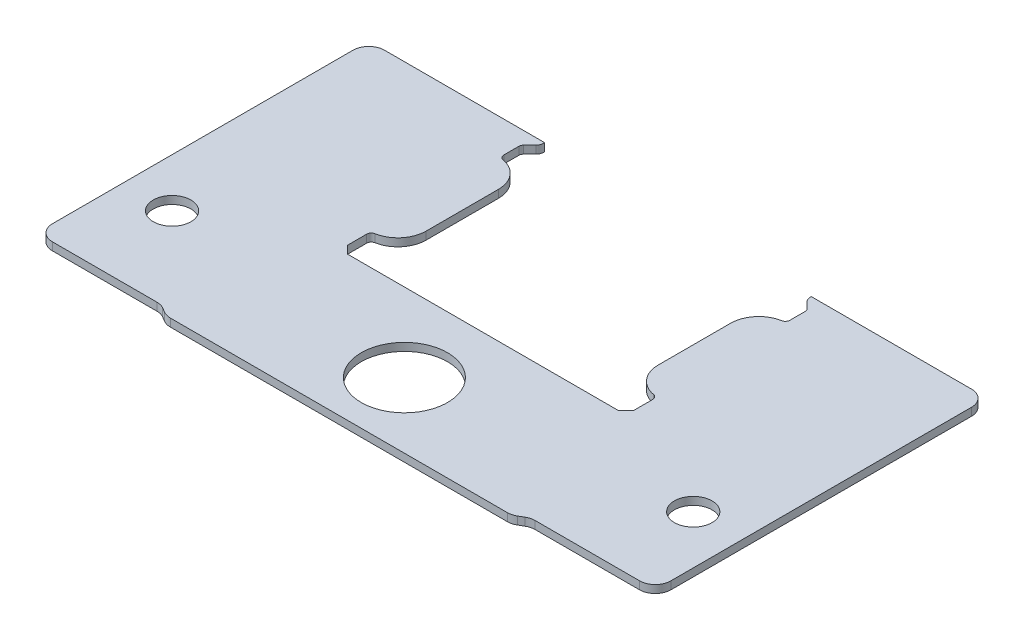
ISO-10303-21;
HEADER;
FILE_DESCRIPTION(('STEP AP214'),'2;1');
FILE_NAME('part.step','',(''),(''),'','','');
FILE_SCHEMA(('AUTOMOTIVE_DESIGN { 1 0 10303 214 1 1 1 1 }'));
ENDSEC;
DATA;
#1=APPLICATION_CONTEXT('core data for automotive mechanical design processes');
#2=APPLICATION_PROTOCOL_DEFINITION('international standard','automotive_design',2000,#1);
#3=PRODUCT_CONTEXT('',#1,'mechanical');
#4=PRODUCT('Part','Part','',(#3));
#5=PRODUCT_RELATED_PRODUCT_CATEGORY('part','',(#4));
#6=PRODUCT_DEFINITION_FORMATION('','',#4);
#7=PRODUCT_DEFINITION_CONTEXT('part definition',#1,'design');
#8=PRODUCT_DEFINITION('design','',#6,#7);
#9=PRODUCT_DEFINITION_SHAPE('','',#8);
#10=(LENGTH_UNIT() NAMED_UNIT(*) SI_UNIT(.MILLI.,.METRE.));
#11=(NAMED_UNIT(*) PLANE_ANGLE_UNIT() SI_UNIT($,.RADIAN.));
#12=(NAMED_UNIT(*) SI_UNIT($,.STERADIAN.) SOLID_ANGLE_UNIT());
#13=UNCERTAINTY_MEASURE_WITH_UNIT(LENGTH_MEASURE(1.E-05),#10,'distance_accuracy_value','');
#14=(GEOMETRIC_REPRESENTATION_CONTEXT(3) GLOBAL_UNCERTAINTY_ASSIGNED_CONTEXT((#13)) GLOBAL_UNIT_ASSIGNED_CONTEXT((#10,
#11,#12)) REPRESENTATION_CONTEXT('',''));
#15=CARTESIAN_POINT('',(0.,0.,0.));
#16=DIRECTION('',(0.,0.,1.));
#17=DIRECTION('',(1.,0.,0.));
#18=AXIS2_PLACEMENT_3D('',#15,#16,#17);
#19=CARTESIAN_POINT('',(-8.991250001,85.3,4.634879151));
#20=DIRECTION('',(0.,1.,0.));
#21=DIRECTION('',(-1.,0.,0.));
#22=AXIS2_PLACEMENT_3D('',#19,#20,#21);
#23=CYLINDRICAL_SURFACE('',#22,0.499999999);
#24=CARTESIAN_POINT('',(-8.99125000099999,85.8,4.634879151));
#25=DIRECTION('',(0.,1.,0.));
#26=DIRECTION('',(-1.,0.,0.));
#27=AXIS2_PLACEMENT_3D('',#24,#25,#26);
#28=CIRCLE('',#27,0.499999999);
#29=CARTESIAN_POINT('',(-8.49547717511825,85.8,4.57));
#30=VERTEX_POINT('',#29);
#31=CARTESIAN_POINT('',(-8.63769660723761,85.8,4.98843253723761));
#32=VERTEX_POINT('',#31);
#33=EDGE_CURVE('E521',#30,#32,#28,.F.);
#34=ORIENTED_EDGE('',*,*,#33,.T.);
#35=DIRECTION('',(0.,-1.,0.));
#36=VECTOR('',#35,1.);
#37=CARTESIAN_POINT('',(-8.637696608,85.55,4.988432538));
#38=LINE('',#37,#36);
#39=CARTESIAN_POINT('',(-8.63769660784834,85.3,4.98843254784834));
#40=VERTEX_POINT('',#39);
#41=EDGE_CURVE('E454',#32,#40,#38,.T.);
#42=ORIENTED_EDGE('',*,*,#41,.T.);
#43=CARTESIAN_POINT('',(-8.991250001,85.3,4.634879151));
#44=DIRECTION('',(0.,1.,0.));
#45=DIRECTION('',(-1.,0.,0.));
#46=AXIS2_PLACEMENT_3D('',#43,#44,#45);
#47=CIRCLE('',#46,0.499999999);
#48=CARTESIAN_POINT('',(-8.49547717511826,85.3,4.57));
#49=VERTEX_POINT('',#48);
#50=EDGE_CURVE('E292',#49,#40,#47,.F.);
#51=ORIENTED_EDGE('',*,*,#50,.F.);
#52=DIRECTION('',(0.,-1.,0.));
#53=VECTOR('',#52,1.);
#54=CARTESIAN_POINT('',(-8.495477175,85.55,4.57));
#55=LINE('',#54,#53);
#56=EDGE_CURVE('E284',#30,#49,#55,.T.);
#57=ORIENTED_EDGE('',*,*,#56,.F.);
#58=EDGE_LOOP('',(#34,#42,#51,#57));
#59=FACE_BOUND('',#58,.T.);
#60=ADVANCED_FACE('F17',(#59),#23,.T.);
#61=CARTESIAN_POINT('',(-8.637696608,85.3,4.988432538));
#62=DIRECTION('',(-0.707106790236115,0.,-0.70710677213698));
#63=DIRECTION('',(-0.70710677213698,0.,0.707106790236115));
#64=AXIS2_PLACEMENT_3D('',#61,#62,#63);
#65=PLANE('',#64);
#66=DIRECTION('',(-0.70710677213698,0.,0.707106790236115));
#67=VECTOR('',#66,1.);
#68=CARTESIAN_POINT('',(-8.637696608,85.8,4.988432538));
#69=LINE('',#68,#67);
#70=CARTESIAN_POINT('',(-9.02838202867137,85.8,5.37911796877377));
#71=VERTEX_POINT('',#70);
#72=EDGE_CURVE('E518',#32,#71,#69,.T.);
#73=ORIENTED_EDGE('',*,*,#72,.T.);
#74=DIRECTION('',(0.,-1.,0.));
#75=VECTOR('',#74,1.);
#76=CARTESIAN_POINT('',(-9.02838203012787,85.55,5.37911797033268));
#77=LINE('',#76,#75);
#78=CARTESIAN_POINT('',(-9.02838202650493,85.3,5.37911796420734));
#79=VERTEX_POINT('',#78);
#80=EDGE_CURVE('E452',#79,#71,#77,.F.);
#81=ORIENTED_EDGE('',*,*,#80,.F.);
#82=DIRECTION('',(-0.707106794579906,0.,0.707106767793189));
#83=VECTOR('',#82,1.);
#84=CARTESIAN_POINT('',(-8.6376965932,85.3,4.9884325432));
#85=LINE('',#84,#83);
#86=EDGE_CURVE('E294',#40,#79,#85,.T.);
#87=ORIENTED_EDGE('',*,*,#86,.F.);
#88=ORIENTED_EDGE('',*,*,#41,.F.);
#89=EDGE_LOOP('',(#73,#81,#87,#88));
#90=FACE_BOUND('',#89,.T.);
#91=ADVANCED_FACE('F588',(#90),#65,.F.);
#92=CARTESIAN_POINT('',(-8.816249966,85.3,5.591250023));
#93=DIRECTION('',(0.,1.,0.));
#94=DIRECTION('',(-1.,0.,0.));
#95=AXIS2_PLACEMENT_3D('',#92,#93,#94);
#96=CYLINDRICAL_SURFACE('',#95,0.300000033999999);
#97=DIRECTION('',(0.,-1.,0.));
#98=VECTOR('',#97,1.);
#99=CARTESIAN_POINT('',(-9.11625,85.55,5.591250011));
#100=LINE('',#99,#98);
#101=CARTESIAN_POINT('',(-9.1162500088,85.8,5.591250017));
#102=VERTEX_POINT('',#101);
#103=CARTESIAN_POINT('',(-9.1162500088,85.3,5.591250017));
#104=VERTEX_POINT('',#103);
#105=EDGE_CURVE('E449',#102,#104,#100,.T.);
#106=ORIENTED_EDGE('',*,*,#105,.T.);
#107=CARTESIAN_POINT('',(-8.816249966,85.3,5.591250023));
#108=DIRECTION('',(0.,1.,0.));
#109=DIRECTION('',(-1.,0.,0.));
#110=AXIS2_PLACEMENT_3D('',#107,#108,#109);
#111=CIRCLE('',#110,0.300000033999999);
#112=EDGE_CURVE('E582',#79,#104,#111,.T.);
#113=ORIENTED_EDGE('',*,*,#112,.F.);
#114=ORIENTED_EDGE('',*,*,#80,.T.);
#115=CARTESIAN_POINT('',(-8.81624996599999,85.8,5.591250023));
#116=DIRECTION('',(0.,1.,0.));
#117=DIRECTION('',(-1.,0.,0.));
#118=AXIS2_PLACEMENT_3D('',#115,#116,#117);
#119=CIRCLE('',#118,0.300000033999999);
#120=EDGE_CURVE('E355',#71,#102,#119,.T.);
#121=ORIENTED_EDGE('',*,*,#120,.T.);
#122=EDGE_LOOP('',(#106,#113,#114,#121));
#123=FACE_BOUND('',#122,.T.);
#124=ADVANCED_FACE('F592',(#123),#96,.F.);
#125=CARTESIAN_POINT('',(-9.11625,85.3,5.591250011));
#126=DIRECTION('',(-1.,0.,0.));
#127=DIRECTION('',(0.,0.,1.));
#128=AXIS2_PLACEMENT_3D('',#125,#126,#127);
#129=PLANE('',#128);
#130=DIRECTION('',(0.,0.,1.));
#131=VECTOR('',#130,1.);
#132=CARTESIAN_POINT('',(-9.1162500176,85.8,15.37));
#133=LINE('',#132,#131);
#134=CARTESIAN_POINT('',(-9.1162500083,85.8,6.5485079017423));
#135=VERTEX_POINT('',#134);
#136=EDGE_CURVE('E352',#102,#135,#133,.T.);
#137=ORIENTED_EDGE('',*,*,#136,.T.);
#138=DIRECTION('',(0.,-1.,0.));
#139=VECTOR('',#138,1.);
#140=CARTESIAN_POINT('',(-9.116249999,85.55,6.54850790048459));
#141=LINE('',#140,#139);
#142=CARTESIAN_POINT('',(-9.1162500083,85.3,6.5485079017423));
#143=VERTEX_POINT('',#142);
#144=EDGE_CURVE('E447',#143,#135,#141,.F.);
#145=ORIENTED_EDGE('',*,*,#144,.F.);
#146=DIRECTION('',(0.,0.,1.));
#147=VECTOR('',#146,1.);
#148=CARTESIAN_POINT('',(-9.1162500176,85.3,15.37));
#149=LINE('',#148,#147);
#150=EDGE_CURVE('E297',#104,#143,#149,.T.);
#151=ORIENTED_EDGE('',*,*,#150,.F.);
#152=ORIENTED_EDGE('',*,*,#105,.F.);
#153=EDGE_LOOP('',(#137,#145,#151,#152));
#154=FACE_BOUND('',#153,.T.);
#155=ADVANCED_FACE('F597',(#154),#129,.F.);
#156=CARTESIAN_POINT('',(-8.816250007,85.3,6.548507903));
#157=DIRECTION('',(0.,1.,0.));
#158=DIRECTION('',(-1.,0.,0.));
#159=AXIS2_PLACEMENT_3D('',#156,#157,#158);
#160=CYLINDRICAL_SURFACE('',#159,0.299999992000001);
#161=DIRECTION('',(0.,1.,0.));
#162=VECTOR('',#161,1.);
#163=CARTESIAN_POINT('',(-8.87013637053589,85.55,6.84362864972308));
#164=LINE('',#163,#162);
#165=CARTESIAN_POINT('',(-8.87013637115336,85.8,6.84362864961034));
#166=VERTEX_POINT('',#165);
#167=CARTESIAN_POINT('',(-8.87013637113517,85.3,6.84362864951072));
#168=VERTEX_POINT('',#167);
#169=EDGE_CURVE('E444',#166,#168,#164,.F.);
#170=ORIENTED_EDGE('',*,*,#169,.T.);
#171=CARTESIAN_POINT('',(-8.816250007,85.3,6.548507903));
#172=DIRECTION('',(0.,1.,0.));
#173=DIRECTION('',(-1.,0.,0.));
#174=AXIS2_PLACEMENT_3D('',#171,#172,#173);
#175=CIRCLE('',#174,0.299999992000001);
#176=EDGE_CURVE('E580',#143,#168,#175,.T.);
#177=ORIENTED_EDGE('',*,*,#176,.F.);
#178=ORIENTED_EDGE('',*,*,#144,.T.);
#179=CARTESIAN_POINT('',(-8.81625000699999,85.8,6.548507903));
#180=DIRECTION('',(0.,1.,0.));
#181=DIRECTION('',(-1.,0.,0.));
#182=AXIS2_PLACEMENT_3D('',#179,#180,#181);
#183=CIRCLE('',#182,0.299999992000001);
#184=EDGE_CURVE('E354',#135,#166,#183,.T.);
#185=ORIENTED_EDGE('',*,*,#184,.T.);
#186=EDGE_LOOP('',(#170,#177,#178,#185));
#187=FACE_BOUND('',#186,.T.);
#188=ADVANCED_FACE('F601',(#187),#160,.F.);
#189=CARTESIAN_POINT('',(-9.193993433,85.3,8.617304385));
#190=DIRECTION('',(0.,1.,0.));
#191=DIRECTION('',(-1.,0.,0.));
#192=AXIS2_PLACEMENT_3D('',#189,#190,#191);
#193=CYLINDRICAL_SURFACE('',#192,1.803000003);
#194=CARTESIAN_POINT('',(-9.193993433,85.8,8.617304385));
#195=DIRECTION('',(0.,1.,0.));
#196=DIRECTION('',(-1.,0.,0.));
#197=AXIS2_PLACEMENT_3D('',#194,#195,#196);
#198=CIRCLE('',#197,1.803000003);
#199=CARTESIAN_POINT('',(-7.3909934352,85.8,8.617304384));
#200=VERTEX_POINT('',#199);
#201=EDGE_CURVE('E351',#166,#200,#198,.F.);
#202=ORIENTED_EDGE('',*,*,#201,.T.);
#203=DIRECTION('',(0.,-1.,0.));
#204=VECTOR('',#203,1.);
#205=CARTESIAN_POINT('',(-7.39099343,85.55,8.617304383));
#206=LINE('',#205,#204);
#207=CARTESIAN_POINT('',(-7.3909934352,85.3,8.617304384));
#208=VERTEX_POINT('',#207);
#209=EDGE_CURVE('E441',#200,#208,#206,.T.);
#210=ORIENTED_EDGE('',*,*,#209,.T.);
#211=CARTESIAN_POINT('',(-9.193993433,85.3,8.617304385));
#212=DIRECTION('',(0.,1.,0.));
#213=DIRECTION('',(-1.,0.,0.));
#214=AXIS2_PLACEMENT_3D('',#211,#212,#213);
#215=CIRCLE('',#214,1.803000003);
#216=EDGE_CURVE('E578',#168,#208,#215,.F.);
#217=ORIENTED_EDGE('',*,*,#216,.F.);
#218=ORIENTED_EDGE('',*,*,#169,.F.);
#219=EDGE_LOOP('',(#202,#210,#217,#218));
#220=FACE_BOUND('',#219,.T.);
#221=ADVANCED_FACE('F605',(#220),#193,.T.);
#222=CARTESIAN_POINT('',(-7.39099343,85.3,8.617304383));
#223=DIRECTION('',(-1.,0.,0.));
#224=DIRECTION('',(0.,0.,1.));
#225=AXIS2_PLACEMENT_3D('',#222,#223,#224);
#226=PLANE('',#225);
#227=DIRECTION('',(0.,0.,1.));
#228=VECTOR('',#227,1.);
#229=CARTESIAN_POINT('',(-7.3909934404,85.8,15.37));
#230=LINE('',#229,#228);
#231=CARTESIAN_POINT('',(-7.3909934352,85.8,13.2226956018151));
#232=VERTEX_POINT('',#231);
#233=EDGE_CURVE('E347',#200,#232,#230,.T.);
#234=ORIENTED_EDGE('',*,*,#233,.T.);
#235=DIRECTION('',(0.,1.,0.));
#236=VECTOR('',#235,1.);
#237=CARTESIAN_POINT('',(-7.39099343,85.55,13.2226956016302));
#238=LINE('',#237,#236);
#239=CARTESIAN_POINT('',(-7.3909934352,85.3,13.2226956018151));
#240=VERTEX_POINT('',#239);
#241=EDGE_CURVE('E438',#232,#240,#238,.F.);
#242=ORIENTED_EDGE('',*,*,#241,.T.);
#243=DIRECTION('',(0.,0.,1.));
#244=VECTOR('',#243,1.);
#245=CARTESIAN_POINT('',(-7.3909934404,85.3,15.37));
#246=LINE('',#245,#244);
#247=EDGE_CURVE('E577',#208,#240,#246,.T.);
#248=ORIENTED_EDGE('',*,*,#247,.F.);
#249=ORIENTED_EDGE('',*,*,#209,.F.);
#250=EDGE_LOOP('',(#234,#242,#248,#249));
#251=FACE_BOUND('',#250,.T.);
#252=ADVANCED_FACE('F609',(#251),#226,.F.);
#253=CARTESIAN_POINT('',(-9.193993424,85.3,13.222695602));
#254=DIRECTION('',(0.,1.,0.));
#255=DIRECTION('',(-1.,0.,0.));
#256=AXIS2_PLACEMENT_3D('',#253,#254,#255);
#257=CYLINDRICAL_SURFACE('',#256,1.802999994);
#258=CARTESIAN_POINT('',(-9.193993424,85.8,13.222695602));
#259=DIRECTION('',(0.,1.,0.));
#260=DIRECTION('',(-1.,0.,0.));
#261=AXIS2_PLACEMENT_3D('',#258,#259,#260);
#262=CIRCLE('',#261,1.802999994);
#263=CARTESIAN_POINT('',(-8.87013636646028,85.8,14.9963713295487));
#264=VERTEX_POINT('',#263);
#265=EDGE_CURVE('E350',#232,#264,#262,.F.);
#266=ORIENTED_EDGE('',*,*,#265,.T.);
#267=DIRECTION('',(0.,-1.,0.));
#268=VECTOR('',#267,1.);
#269=CARTESIAN_POINT('',(-8.87013636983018,85.55,14.996371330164));
#270=LINE('',#269,#268);
#271=CARTESIAN_POINT('',(-8.87013636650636,85.3,14.9963713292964));
#272=VERTEX_POINT('',#271);
#273=EDGE_CURVE('E436',#272,#264,#270,.F.);
#274=ORIENTED_EDGE('',*,*,#273,.F.);
#275=CARTESIAN_POINT('',(-9.193993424,85.3,13.222695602));
#276=DIRECTION('',(0.,1.,0.));
#277=DIRECTION('',(-1.,0.,0.));
#278=AXIS2_PLACEMENT_3D('',#275,#276,#277);
#279=CIRCLE('',#278,1.802999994);
#280=EDGE_CURVE('E575',#240,#272,#279,.F.);
#281=ORIENTED_EDGE('',*,*,#280,.F.);
#282=ORIENTED_EDGE('',*,*,#241,.F.);
#283=EDGE_LOOP('',(#266,#274,#281,#282));
#284=FACE_BOUND('',#283,.T.);
#285=ADVANCED_FACE('F666',(#284),#257,.T.);
#286=CARTESIAN_POINT('',(-8.816249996,85.3,15.291492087));
#287=DIRECTION('',(0.,1.,0.));
#288=DIRECTION('',(-1.,0.,0.));
#289=AXIS2_PLACEMENT_3D('',#286,#287,#288);
#290=CYLINDRICAL_SURFACE('',#289,0.300000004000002);
#291=DIRECTION('',(0.,-1.,0.));
#292=VECTOR('',#291,1.);
#293=CARTESIAN_POINT('',(-9.11625,85.55,15.291492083));
#294=LINE('',#293,#292);
#295=CARTESIAN_POINT('',(-9.1162500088,85.8,15.291492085));
#296=VERTEX_POINT('',#295);
#297=CARTESIAN_POINT('',(-9.1162500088,85.3,15.291492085));
#298=VERTEX_POINT('',#297);
#299=EDGE_CURVE('E433',#296,#298,#294,.T.);
#300=ORIENTED_EDGE('',*,*,#299,.T.);
#301=CARTESIAN_POINT('',(-8.816249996,85.3,15.291492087));
#302=DIRECTION('',(0.,1.,0.));
#303=DIRECTION('',(-1.,0.,0.));
#304=AXIS2_PLACEMENT_3D('',#301,#302,#303);
#305=CIRCLE('',#304,0.300000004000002);
#306=EDGE_CURVE('E573',#272,#298,#305,.T.);
#307=ORIENTED_EDGE('',*,*,#306,.F.);
#308=ORIENTED_EDGE('',*,*,#273,.T.);
#309=CARTESIAN_POINT('',(-8.81624999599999,85.8,15.291492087));
#310=DIRECTION('',(0.,1.,0.));
#311=DIRECTION('',(-1.,0.,0.));
#312=AXIS2_PLACEMENT_3D('',#309,#310,#311);
#313=CIRCLE('',#312,0.300000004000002);
#314=EDGE_CURVE('E346',#264,#296,#313,.T.);
#315=ORIENTED_EDGE('',*,*,#314,.T.);
#316=EDGE_LOOP('',(#300,#307,#308,#315));
#317=FACE_BOUND('',#316,.T.);
#318=ADVANCED_FACE('F671',(#317),#290,.F.);
#319=CARTESIAN_POINT('',(-9.11625,85.3,15.291492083));
#320=DIRECTION('',(-1.,0.,0.));
#321=DIRECTION('',(0.,0.,1.));
#322=AXIS2_PLACEMENT_3D('',#319,#320,#321);
#323=PLANE('',#322);
#324=DIRECTION('',(0.,0.,1.));
#325=VECTOR('',#324,1.);
#326=CARTESIAN_POINT('',(-9.1162500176,85.8,15.37));
#327=LINE('',#326,#325);
#328=CARTESIAN_POINT('',(-9.1162500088,85.8,16.5087499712));
#329=VERTEX_POINT('',#328);
#330=EDGE_CURVE('E342',#296,#329,#327,.T.);
#331=ORIENTED_EDGE('',*,*,#330,.T.);
#332=DIRECTION('',(0.,-1.,0.));
#333=VECTOR('',#332,1.);
#334=CARTESIAN_POINT('',(-9.11625,85.55,16.50874998));
#335=LINE('',#334,#333);
#336=CARTESIAN_POINT('',(-9.1162500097,85.3,16.5087499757));
#337=VERTEX_POINT('',#336);
#338=EDGE_CURVE('E430',#329,#337,#335,.T.);
#339=ORIENTED_EDGE('',*,*,#338,.T.);
#340=DIRECTION('',(0.,0.,1.));
#341=VECTOR('',#340,1.);
#342=CARTESIAN_POINT('',(-9.1162500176,85.3,15.37));
#343=LINE('',#342,#341);
#344=EDGE_CURVE('E572',#298,#337,#343,.T.);
#345=ORIENTED_EDGE('',*,*,#344,.F.);
#346=ORIENTED_EDGE('',*,*,#299,.F.);
#347=EDGE_LOOP('',(#331,#339,#345,#346));
#348=FACE_BOUND('',#347,.T.);
#349=ADVANCED_FACE('F667',(#348),#323,.F.);
#350=CARTESIAN_POINT('',(-9.11625,85.3,16.50874998));
#351=DIRECTION('',(-0.707106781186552,0.,0.707106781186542));
#352=DIRECTION('',(0.707106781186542,0.,0.707106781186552));
#353=AXIS2_PLACEMENT_3D('',#350,#351,#352);
#354=PLANE('',#353);
#355=DIRECTION('',(0.707106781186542,0.,0.707106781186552));
#356=VECTOR('',#355,1.);
#357=CARTESIAN_POINT('',(-9.11625,85.8,16.50874998));
#358=LINE('',#357,#356);
#359=CARTESIAN_POINT('',(-8.6250000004,85.8,16.9999999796));
#360=VERTEX_POINT('',#359);
#361=EDGE_CURVE('E345',#329,#360,#358,.T.);
#362=ORIENTED_EDGE('',*,*,#361,.T.);
#363=DIRECTION('',(0.,-1.,0.));
#364=VECTOR('',#363,1.);
#365=CARTESIAN_POINT('',(-8.625,85.55,16.99999998));
#366=LINE('',#365,#364);
#367=CARTESIAN_POINT('',(-8.6249999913,85.3,16.9999999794));
#368=VERTEX_POINT('',#367);
#369=EDGE_CURVE('E424',#360,#368,#366,.T.);
#370=ORIENTED_EDGE('',*,*,#369,.T.);
#371=DIRECTION('',(0.707106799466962,0.,0.707106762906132));
#372=VECTOR('',#371,1.);
#373=CARTESIAN_POINT('',(-9.1162500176,85.3,16.5087499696));
#374=LINE('',#373,#372);
#375=EDGE_CURVE('E459',#337,#368,#374,.T.);
#376=ORIENTED_EDGE('',*,*,#375,.F.);
#377=ORIENTED_EDGE('',*,*,#338,.F.);
#378=EDGE_LOOP('',(#362,#370,#376,#377));
#379=FACE_BOUND('',#378,.T.);
#380=ADVANCED_FACE('F670',(#379),#354,.F.);
#381=CARTESIAN_POINT('',(-8.625,85.8,16.99999998));
#382=DIRECTION('',(0.,0.,1.));
#383=DIRECTION('',(0.,-1.,0.));
#384=AXIS2_PLACEMENT_3D('',#381,#382,#383);
#385=PLANE('',#384);
#386=DIRECTION('',(1.,0.,0.));
#387=VECTOR('',#386,1.);
#388=CARTESIAN_POINT('',(0.,85.8,16.9999999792));
#389=LINE('',#388,#387);
#390=CARTESIAN_POINT('',(8.6250000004,85.8,16.9999999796));
#391=VERTEX_POINT('',#390);
#392=EDGE_CURVE('E425',#360,#391,#389,.T.);
#393=ORIENTED_EDGE('',*,*,#392,.T.);
#394=DIRECTION('',(0.,-1.,0.));
#395=VECTOR('',#394,1.);
#396=CARTESIAN_POINT('',(8.625,85.55,16.99999998));
#397=LINE('',#396,#395);
#398=CARTESIAN_POINT('',(8.6249999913,85.3,16.9999999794));
#399=VERTEX_POINT('',#398);
#400=EDGE_CURVE('E421',#391,#399,#397,.T.);
#401=ORIENTED_EDGE('',*,*,#400,.T.);
#402=DIRECTION('',(1.,0.,0.));
#403=VECTOR('',#402,1.);
#404=CARTESIAN_POINT('',(0.,85.3,16.9999999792));
#405=LINE('',#404,#403);
#406=EDGE_CURVE('E457',#368,#399,#405,.T.);
#407=ORIENTED_EDGE('',*,*,#406,.F.);
#408=ORIENTED_EDGE('',*,*,#369,.F.);
#409=EDGE_LOOP('',(#393,#401,#407,#408));
#410=FACE_BOUND('',#409,.T.);
#411=ADVANCED_FACE('F675',(#410),#385,.F.);
#412=CARTESIAN_POINT('',(8.625,85.3,16.99999998));
#413=DIRECTION('',(0.707106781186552,0.,0.707106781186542));
#414=DIRECTION('',(0.707106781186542,0.,-0.707106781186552));
#415=AXIS2_PLACEMENT_3D('',#412,#413,#414);
#416=PLANE('',#415);
#417=DIRECTION('',(0.707106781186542,0.,-0.707106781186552));
#418=VECTOR('',#417,1.);
#419=CARTESIAN_POINT('',(8.625,85.8,16.99999998));
#420=LINE('',#419,#418);
#421=CARTESIAN_POINT('',(9.1162500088,85.8,16.5087499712));
#422=VERTEX_POINT('',#421);
#423=EDGE_CURVE('E341',#391,#422,#420,.T.);
#424=ORIENTED_EDGE('',*,*,#423,.T.);
#425=DIRECTION('',(0.,-1.,0.));
#426=VECTOR('',#425,1.);
#427=CARTESIAN_POINT('',(9.11625,85.55,16.50874998));
#428=LINE('',#427,#426);
#429=CARTESIAN_POINT('',(9.1162500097,85.3,16.5087499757));
#430=VERTEX_POINT('',#429);
#431=EDGE_CURVE('E418',#422,#430,#428,.T.);
#432=ORIENTED_EDGE('',*,*,#431,.T.);
#433=DIRECTION('',(0.70710679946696,0.,-0.707106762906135));
#434=VECTOR('',#433,1.);
#435=CARTESIAN_POINT('',(8.6249999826,85.3,16.9999999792));
#436=LINE('',#435,#434);
#437=EDGE_CURVE('E458',#399,#430,#436,.T.);
#438=ORIENTED_EDGE('',*,*,#437,.F.);
#439=ORIENTED_EDGE('',*,*,#400,.F.);
#440=EDGE_LOOP('',(#424,#432,#438,#439));
#441=FACE_BOUND('',#440,.T.);
#442=ADVANCED_FACE('F679',(#441),#416,.F.);
#443=CARTESIAN_POINT('',(9.11625,85.3,16.50874998));
#444=DIRECTION('',(1.,0.,0.));
#445=DIRECTION('',(0.,0.,-1.));
#446=AXIS2_PLACEMENT_3D('',#443,#444,#445);
#447=PLANE('',#446);
#448=DIRECTION('',(0.,0.,-1.));
#449=VECTOR('',#448,1.);
#450=CARTESIAN_POINT('',(9.1162500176,85.8,15.37));
#451=LINE('',#450,#449);
#452=CARTESIAN_POINT('',(9.1162500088,85.8,15.2914920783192));
#453=VERTEX_POINT('',#452);
#454=EDGE_CURVE('E337',#422,#453,#451,.T.);
#455=ORIENTED_EDGE('',*,*,#454,.T.);
#456=DIRECTION('',(0.,-1.,0.));
#457=VECTOR('',#456,1.);
#458=CARTESIAN_POINT('',(9.11625,85.55,15.2914920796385));
#459=LINE('',#458,#457);
#460=CARTESIAN_POINT('',(9.1162500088,85.3,15.2914920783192));
#461=VERTEX_POINT('',#460);
#462=EDGE_CURVE('E416',#461,#453,#459,.F.);
#463=ORIENTED_EDGE('',*,*,#462,.F.);
#464=DIRECTION('',(0.,0.,-1.));
#465=VECTOR('',#464,1.);
#466=CARTESIAN_POINT('',(9.1162500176,85.3,15.37));
#467=LINE('',#466,#465);
#468=EDGE_CURVE('E569',#430,#461,#467,.T.);
#469=ORIENTED_EDGE('',*,*,#468,.F.);
#470=ORIENTED_EDGE('',*,*,#431,.F.);
#471=EDGE_LOOP('',(#455,#463,#469,#470));
#472=FACE_BOUND('',#471,.T.);
#473=ADVANCED_FACE('F683',(#472),#447,.F.);
#474=CARTESIAN_POINT('',(8.816250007,85.3,15.291492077));
#475=DIRECTION('',(0.,1.,0.));
#476=DIRECTION('',(-1.,0.,0.));
#477=AXIS2_PLACEMENT_3D('',#474,#475,#476);
#478=CYLINDRICAL_SURFACE('',#477,0.299999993);
#479=DIRECTION('',(0.,1.,0.));
#480=VECTOR('',#479,1.);
#481=CARTESIAN_POINT('',(8.87013636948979,85.55,14.9963713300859));
#482=LINE('',#481,#480);
#483=CARTESIAN_POINT('',(8.87013637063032,85.8,14.9963713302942));
#484=VERTEX_POINT('',#483);
#485=CARTESIAN_POINT('',(8.87013637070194,85.3,14.9963713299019));
#486=VERTEX_POINT('',#485);
#487=EDGE_CURVE('E413',#484,#486,#482,.F.);
#488=ORIENTED_EDGE('',*,*,#487,.T.);
#489=CARTESIAN_POINT('',(8.816250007,85.3,15.291492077));
#490=DIRECTION('',(0.,1.,0.));
#491=DIRECTION('',(-1.,0.,0.));
#492=AXIS2_PLACEMENT_3D('',#489,#490,#491);
#493=CIRCLE('',#492,0.299999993);
#494=EDGE_CURVE('E567',#461,#486,#493,.T.);
#495=ORIENTED_EDGE('',*,*,#494,.F.);
#496=ORIENTED_EDGE('',*,*,#462,.T.);
#497=CARTESIAN_POINT('',(8.81625000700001,85.8,15.291492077));
#498=DIRECTION('',(0.,1.,0.));
#499=DIRECTION('',(-1.,0.,0.));
#500=AXIS2_PLACEMENT_3D('',#497,#498,#499);
#501=CIRCLE('',#500,0.299999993);
#502=EDGE_CURVE('E340',#453,#484,#501,.T.);
#503=ORIENTED_EDGE('',*,*,#502,.T.);
#504=EDGE_LOOP('',(#488,#495,#496,#503));
#505=FACE_BOUND('',#504,.T.);
#506=ADVANCED_FACE('F687',(#505),#478,.F.);
#507=CARTESIAN_POINT('',(9.193993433,85.3,13.222695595));
#508=DIRECTION('',(0.,1.,0.));
#509=DIRECTION('',(-1.,0.,0.));
#510=AXIS2_PLACEMENT_3D('',#507,#508,#509);
#511=CYLINDRICAL_SURFACE('',#510,1.803000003);
#512=CARTESIAN_POINT('',(9.193993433,85.8,13.222695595));
#513=DIRECTION('',(0.,1.,0.));
#514=DIRECTION('',(-1.,0.,0.));
#515=AXIS2_PLACEMENT_3D('',#512,#513,#514);
#516=CIRCLE('',#515,1.803000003);
#517=CARTESIAN_POINT('',(7.3909934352,85.8,13.222695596));
#518=VERTEX_POINT('',#517);
#519=EDGE_CURVE('E336',#484,#518,#516,.F.);
#520=ORIENTED_EDGE('',*,*,#519,.T.);
#521=DIRECTION('',(0.,-1.,0.));
#522=VECTOR('',#521,1.);
#523=CARTESIAN_POINT('',(7.39099343,85.55,13.222695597));
#524=LINE('',#523,#522);
#525=CARTESIAN_POINT('',(7.3909934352,85.3,13.222695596));
#526=VERTEX_POINT('',#525);
#527=EDGE_CURVE('E410',#518,#526,#524,.T.);
#528=ORIENTED_EDGE('',*,*,#527,.T.);
#529=CARTESIAN_POINT('',(9.193993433,85.3,13.222695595));
#530=DIRECTION('',(0.,1.,0.));
#531=DIRECTION('',(-1.,0.,0.));
#532=AXIS2_PLACEMENT_3D('',#529,#530,#531);
#533=CIRCLE('',#532,1.803000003);
#534=EDGE_CURVE('E565',#486,#526,#533,.F.);
#535=ORIENTED_EDGE('',*,*,#534,.F.);
#536=ORIENTED_EDGE('',*,*,#487,.F.);
#537=EDGE_LOOP('',(#520,#528,#535,#536));
#538=FACE_BOUND('',#537,.T.);
#539=ADVANCED_FACE('F693',(#538),#511,.T.);
#540=CARTESIAN_POINT('',(7.39099343,85.3,13.222695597));
#541=DIRECTION('',(1.,0.,0.));
#542=DIRECTION('',(0.,0.,-1.));
#543=AXIS2_PLACEMENT_3D('',#540,#541,#542);
#544=PLANE('',#543);
#545=DIRECTION('',(0.,0.,-1.));
#546=VECTOR('',#545,1.);
#547=CARTESIAN_POINT('',(7.3909934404,85.8,15.37));
#548=LINE('',#547,#546);
#549=CARTESIAN_POINT('',(7.3909934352,85.8,8.6173043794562));
#550=VERTEX_POINT('',#549);
#551=EDGE_CURVE('E332',#518,#550,#548,.T.);
#552=ORIENTED_EDGE('',*,*,#551,.T.);
#553=DIRECTION('',(0.,1.,0.));
#554=VECTOR('',#553,1.);
#555=CARTESIAN_POINT('',(7.39099343,85.55,8.6173043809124));
#556=LINE('',#555,#554);
#557=CARTESIAN_POINT('',(7.3909934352,85.3,8.6173043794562));
#558=VERTEX_POINT('',#557);
#559=EDGE_CURVE('E407',#550,#558,#556,.F.);
#560=ORIENTED_EDGE('',*,*,#559,.T.);
#561=DIRECTION('',(0.,0.,-1.));
#562=VECTOR('',#561,1.);
#563=CARTESIAN_POINT('',(7.3909934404,85.3,15.37));
#564=LINE('',#563,#562);
#565=EDGE_CURVE('E564',#526,#558,#564,.T.);
#566=ORIENTED_EDGE('',*,*,#565,.F.);
#567=ORIENTED_EDGE('',*,*,#527,.F.);
#568=EDGE_LOOP('',(#552,#560,#566,#567));
#569=FACE_BOUND('',#568,.T.);
#570=ADVANCED_FACE('F689',(#569),#544,.F.);
#571=CARTESIAN_POINT('',(9.193993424,85.3,8.617304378));
#572=DIRECTION('',(0.,1.,0.));
#573=DIRECTION('',(-1.,0.,0.));
#574=AXIS2_PLACEMENT_3D('',#571,#572,#573);
#575=CYLINDRICAL_SURFACE('',#574,1.802999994);
#576=CARTESIAN_POINT('',(9.193993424,85.8,8.617304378));
#577=DIRECTION('',(0.,1.,0.));
#578=DIRECTION('',(-1.,0.,0.));
#579=AXIS2_PLACEMENT_3D('',#576,#577,#578);
#580=CIRCLE('',#579,1.802999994);
#581=CARTESIAN_POINT('',(8.87013636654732,85.8,6.84362865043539));
#582=VERTEX_POINT('',#581);
#583=EDGE_CURVE('E335',#550,#582,#580,.F.);
#584=ORIENTED_EDGE('',*,*,#583,.T.);
#585=DIRECTION('',(0.,-1.,0.));
#586=VECTOR('',#585,1.);
#587=CARTESIAN_POINT('',(8.87013637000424,85.55,6.84362864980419));
#588=LINE('',#587,#586);
#589=CARTESIAN_POINT('',(8.87013636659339,85.3,6.8436286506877));
#590=VERTEX_POINT('',#589);
#591=EDGE_CURVE('E405',#590,#582,#588,.F.);
#592=ORIENTED_EDGE('',*,*,#591,.F.);
#593=CARTESIAN_POINT('',(9.193993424,85.3,8.617304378));
#594=DIRECTION('',(0.,1.,0.));
#595=DIRECTION('',(-1.,0.,0.));
#596=AXIS2_PLACEMENT_3D('',#593,#594,#595);
#597=CIRCLE('',#596,1.802999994);
#598=EDGE_CURVE('E562',#558,#590,#597,.F.);
#599=ORIENTED_EDGE('',*,*,#598,.F.);
#600=ORIENTED_EDGE('',*,*,#559,.F.);
#601=EDGE_LOOP('',(#584,#592,#599,#600));
#602=FACE_BOUND('',#601,.T.);
#603=ADVANCED_FACE('F692',(#602),#575,.T.);
#604=CARTESIAN_POINT('',(8.816249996,85.3,6.548507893));
#605=DIRECTION('',(0.,1.,0.));
#606=DIRECTION('',(-1.,0.,0.));
#607=AXIS2_PLACEMENT_3D('',#604,#605,#606);
#608=CYLINDRICAL_SURFACE('',#607,0.300000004);
#609=DIRECTION('',(0.,-1.,0.));
#610=VECTOR('',#609,1.);
#611=CARTESIAN_POINT('',(9.11625,85.55,6.548507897));
#612=LINE('',#611,#610);
#613=CARTESIAN_POINT('',(9.1162500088,85.8,6.548507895));
#614=VERTEX_POINT('',#613);
#615=CARTESIAN_POINT('',(9.1162500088,85.3,6.548507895));
#616=VERTEX_POINT('',#615);
#617=EDGE_CURVE('E402',#614,#616,#612,.T.);
#618=ORIENTED_EDGE('',*,*,#617,.T.);
#619=CARTESIAN_POINT('',(8.816249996,85.3,6.548507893));
#620=DIRECTION('',(0.,1.,0.));
#621=DIRECTION('',(-1.,0.,0.));
#622=AXIS2_PLACEMENT_3D('',#619,#620,#621);
#623=CIRCLE('',#622,0.300000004);
#624=EDGE_CURVE('E560',#590,#616,#623,.T.);
#625=ORIENTED_EDGE('',*,*,#624,.F.);
#626=ORIENTED_EDGE('',*,*,#591,.T.);
#627=CARTESIAN_POINT('',(8.81624999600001,85.8,6.548507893));
#628=DIRECTION('',(0.,1.,0.));
#629=DIRECTION('',(-1.,0.,0.));
#630=AXIS2_PLACEMENT_3D('',#627,#628,#629);
#631=CIRCLE('',#630,0.300000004);
#632=EDGE_CURVE('E331',#582,#614,#631,.T.);
#633=ORIENTED_EDGE('',*,*,#632,.T.);
#634=EDGE_LOOP('',(#618,#625,#626,#633));
#635=FACE_BOUND('',#634,.T.);
#636=ADVANCED_FACE('F699',(#635),#608,.F.);
#637=CARTESIAN_POINT('',(9.11625,85.3,6.548507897));
#638=DIRECTION('',(1.,0.,0.));
#639=DIRECTION('',(0.,0.,-1.));
#640=AXIS2_PLACEMENT_3D('',#637,#638,#639);
#641=PLANE('',#640);
#642=DIRECTION('',(0.,0.,-1.));
#643=VECTOR('',#642,1.);
#644=CARTESIAN_POINT('',(9.1162500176,85.8,15.37));
#645=LINE('',#644,#643);
#646=CARTESIAN_POINT('',(9.1162500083,85.8,5.59124999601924));
#647=VERTEX_POINT('',#646);
#648=EDGE_CURVE('E327',#614,#647,#645,.T.);
#649=ORIENTED_EDGE('',*,*,#648,.T.);
#650=DIRECTION('',(0.,-1.,0.));
#651=VECTOR('',#650,1.);
#652=CARTESIAN_POINT('',(9.116249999,85.55,5.59125000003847));
#653=LINE('',#652,#651);
#654=CARTESIAN_POINT('',(9.1162500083,85.3,5.59124999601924));
#655=VERTEX_POINT('',#654);
#656=EDGE_CURVE('E400',#655,#647,#653,.F.);
#657=ORIENTED_EDGE('',*,*,#656,.F.);
#658=DIRECTION('',(0.,0.,-1.));
#659=VECTOR('',#658,1.);
#660=CARTESIAN_POINT('',(9.1162500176,85.3,15.37));
#661=LINE('',#660,#659);
#662=EDGE_CURVE('E559',#616,#655,#661,.T.);
#663=ORIENTED_EDGE('',*,*,#662,.F.);
#664=ORIENTED_EDGE('',*,*,#617,.F.);
#665=EDGE_LOOP('',(#649,#657,#663,#664));
#666=FACE_BOUND('',#665,.T.);
#667=ADVANCED_FACE('F695',(#666),#641,.F.);
#668=CARTESIAN_POINT('',(8.81625004,85.3,5.591249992));
#669=DIRECTION('',(0.,1.,0.));
#670=DIRECTION('',(-1.,0.,0.));
#671=AXIS2_PLACEMENT_3D('',#668,#669,#670);
#672=CYLINDRICAL_SURFACE('',#671,0.299999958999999);
#673=DIRECTION('',(0.,-1.,0.));
#674=VECTOR('',#673,1.);
#675=CARTESIAN_POINT('',(9.028382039,85.55,5.379117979));
#676=LINE('',#675,#674);
#677=CARTESIAN_POINT('',(9.02838204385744,85.8,5.37911798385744));
#678=VERTEX_POINT('',#677);
#679=CARTESIAN_POINT('',(9.02838203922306,85.3,5.37911798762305));
#680=VERTEX_POINT('',#679);
#681=EDGE_CURVE('E397',#678,#680,#676,.T.);
#682=ORIENTED_EDGE('',*,*,#681,.T.);
#683=CARTESIAN_POINT('',(8.81625004,85.3,5.591249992));
#684=DIRECTION('',(0.,1.,0.));
#685=DIRECTION('',(-1.,0.,0.));
#686=AXIS2_PLACEMENT_3D('',#683,#684,#685);
#687=CIRCLE('',#686,0.299999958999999);
#688=EDGE_CURVE('E557',#655,#680,#687,.T.);
#689=ORIENTED_EDGE('',*,*,#688,.F.);
#690=ORIENTED_EDGE('',*,*,#656,.T.);
#691=CARTESIAN_POINT('',(8.81625004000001,85.8,5.591249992));
#692=DIRECTION('',(0.,1.,0.));
#693=DIRECTION('',(-1.,0.,0.));
#694=AXIS2_PLACEMENT_3D('',#691,#692,#693);
#695=CIRCLE('',#694,0.299999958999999);
#696=EDGE_CURVE('E330',#647,#678,#695,.T.);
#697=ORIENTED_EDGE('',*,*,#696,.T.);
#698=EDGE_LOOP('',(#682,#689,#690,#697));
#699=FACE_BOUND('',#698,.T.);
#700=ADVANCED_FACE('F698',(#699),#672,.F.);
#701=CARTESIAN_POINT('',(9.028382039,85.3,5.379117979));
#702=DIRECTION('',(0.707106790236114,0.,-0.707106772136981));
#703=DIRECTION('',(-0.707106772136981,0.,-0.707106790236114));
#704=AXIS2_PLACEMENT_3D('',#701,#702,#703);
#705=PLANE('',#704);
#706=DIRECTION('',(-0.707106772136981,0.,-0.707106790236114));
#707=VECTOR('',#706,1.);
#708=CARTESIAN_POINT('',(9.028382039,85.8,5.379117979));
#709=LINE('',#708,#707);
#710=CARTESIAN_POINT('',(8.63769660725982,85.8,4.98843253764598));
#711=VERTEX_POINT('',#710);
#712=EDGE_CURVE('E491',#678,#711,#709,.T.);
#713=ORIENTED_EDGE('',*,*,#712,.T.);
#714=DIRECTION('',(0.,1.,0.));
#715=VECTOR('',#714,1.);
#716=CARTESIAN_POINT('',(8.63769660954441,85.55,4.98843254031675));
#717=LINE('',#716,#715);
#718=CARTESIAN_POINT('',(8.63769660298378,85.3,4.98843254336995));
#719=VERTEX_POINT('',#718);
#720=EDGE_CURVE('E394',#711,#719,#717,.F.);
#721=ORIENTED_EDGE('',*,*,#720,.T.);
#722=DIRECTION('',(-0.707106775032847,0.,-0.707106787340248));
#723=VECTOR('',#722,1.);
#724=CARTESIAN_POINT('',(9.0283820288,85.3,5.3791179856));
#725=LINE('',#724,#723);
#726=EDGE_CURVE('E555',#680,#719,#725,.T.);
#727=ORIENTED_EDGE('',*,*,#726,.F.);
#728=ORIENTED_EDGE('',*,*,#681,.F.);
#729=EDGE_LOOP('',(#713,#721,#727,#728));
#730=FACE_BOUND('',#729,.T.);
#731=ADVANCED_FACE('F701',(#730),#705,.F.);
#732=CARTESIAN_POINT('',(8.991249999,85.3,4.63487915));
#733=DIRECTION('',(0.,1.,0.));
#734=DIRECTION('',(-1.,0.,0.));
#735=AXIS2_PLACEMENT_3D('',#732,#733,#734);
#736=CYLINDRICAL_SURFACE('',#735,0.499999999);
#737=CARTESIAN_POINT('',(8.99124999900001,85.8,4.63487915));
#738=DIRECTION('',(0.,1.,0.));
#739=DIRECTION('',(-1.,0.,0.));
#740=AXIS2_PLACEMENT_3D('',#737,#738,#739);
#741=CIRCLE('',#740,0.499999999);
#742=CARTESIAN_POINT('',(8.49547717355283,85.8,4.57));
#743=VERTEX_POINT('',#742);
#744=EDGE_CURVE('E326',#711,#743,#741,.F.);
#745=ORIENTED_EDGE('',*,*,#744,.T.);
#746=DIRECTION('',(0.,1.,0.));
#747=VECTOR('',#746,1.);
#748=CARTESIAN_POINT('',(8.495477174,85.55,4.57));
#749=LINE('',#748,#747);
#750=CARTESIAN_POINT('',(8.49547717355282,85.3,4.57));
#751=VERTEX_POINT('',#750);
#752=EDGE_CURVE('E392',#751,#743,#749,.T.);
#753=ORIENTED_EDGE('',*,*,#752,.F.);
#754=CARTESIAN_POINT('',(8.991249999,85.3,4.63487915));
#755=DIRECTION('',(0.,1.,0.));
#756=DIRECTION('',(-1.,0.,0.));
#757=AXIS2_PLACEMENT_3D('',#754,#755,#756);
#758=CIRCLE('',#757,0.499999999);
#759=EDGE_CURVE('E553',#719,#751,#758,.F.);
#760=ORIENTED_EDGE('',*,*,#759,.F.);
#761=ORIENTED_EDGE('',*,*,#720,.F.);
#762=EDGE_LOOP('',(#745,#753,#760,#761));
#763=FACE_BOUND('',#762,.T.);
#764=ADVANCED_FACE('F704',(#763),#736,.T.);
#765=CARTESIAN_POINT('',(8.495477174,85.3,4.57));
#766=DIRECTION('',(0.,0.,-1.));
#767=DIRECTION('',(0.,1.,0.));
#768=AXIS2_PLACEMENT_3D('',#765,#766,#767);
#769=PLANE('',#768);
#770=ORIENTED_EDGE('',*,*,#752,.T.);
#771=DIRECTION('',(1.,0.,0.));
#772=VECTOR('',#771,1.);
#773=CARTESIAN_POINT('',(0.,85.8,4.57));
#774=LINE('',#773,#772);
#775=CARTESIAN_POINT('',(18.7,85.8,4.57));
#776=VERTEX_POINT('',#775);
#777=EDGE_CURVE('E323',#743,#776,#774,.T.);
#778=ORIENTED_EDGE('',*,*,#777,.T.);
#779=DIRECTION('',(0.,1.,0.));
#780=VECTOR('',#779,1.);
#781=CARTESIAN_POINT('',(18.7,85.55,4.57));
#782=LINE('',#781,#780);
#783=CARTESIAN_POINT('',(18.7,85.3,4.57));
#784=VERTEX_POINT('',#783);
#785=EDGE_CURVE('E389',#776,#784,#782,.F.);
#786=ORIENTED_EDGE('',*,*,#785,.T.);
#787=DIRECTION('',(1.,0.,0.));
#788=VECTOR('',#787,1.);
#789=CARTESIAN_POINT('',(0.,85.3,4.57));
#790=LINE('',#789,#788);
#791=EDGE_CURVE('E552',#751,#784,#790,.T.);
#792=ORIENTED_EDGE('',*,*,#791,.F.);
#793=EDGE_LOOP('',(#770,#778,#786,#792));
#794=FACE_BOUND('',#793,.T.);
#795=ADVANCED_FACE('F706',(#794),#769,.T.);
#796=CARTESIAN_POINT('',(18.7,85.8,5.57));
#797=DIRECTION('',(0.,-1.,0.));
#798=DIRECTION('',(0.,0.,-1.));
#799=AXIS2_PLACEMENT_3D('',#796,#797,#798);
#800=CYLINDRICAL_SURFACE('',#799,1.);
#801=DIRECTION('',(0.,1.,0.));
#802=VECTOR('',#801,1.);
#803=CARTESIAN_POINT('',(19.7,85.55,5.57));
#804=LINE('',#803,#802);
#805=CARTESIAN_POINT('',(19.7,85.3,5.57));
#806=VERTEX_POINT('',#805);
#807=CARTESIAN_POINT('',(19.7,85.8,5.57));
#808=VERTEX_POINT('',#807);
#809=EDGE_CURVE('E387',#806,#808,#804,.T.);
#810=ORIENTED_EDGE('',*,*,#809,.F.);
#811=CARTESIAN_POINT('',(18.7,85.3,5.57));
#812=DIRECTION('',(0.,-1.,0.));
#813=DIRECTION('',(0.,0.,-1.));
#814=AXIS2_PLACEMENT_3D('',#811,#812,#813);
#815=CIRCLE('',#814,1.);
#816=EDGE_CURVE('E550',#784,#806,#815,.T.);
#817=ORIENTED_EDGE('',*,*,#816,.F.);
#818=ORIENTED_EDGE('',*,*,#785,.F.);
#819=CARTESIAN_POINT('',(18.7,85.8,5.57));
#820=DIRECTION('',(0.,-1.,0.));
#821=DIRECTION('',(0.,0.,-1.));
#822=AXIS2_PLACEMENT_3D('',#819,#820,#821);
#823=CIRCLE('',#822,1.);
#824=EDGE_CURVE('E322',#776,#808,#823,.T.);
#825=ORIENTED_EDGE('',*,*,#824,.T.);
#826=EDGE_LOOP('',(#810,#817,#818,#825));
#827=FACE_BOUND('',#826,.T.);
#828=ADVANCED_FACE('F709',(#827),#800,.T.);
#829=CARTESIAN_POINT('',(19.7,85.3,24.72));
#830=DIRECTION('',(1.,0.,0.));
#831=DIRECTION('',(0.,0.,-1.));
#832=AXIS2_PLACEMENT_3D('',#829,#830,#831);
#833=PLANE('',#832);
#834=DIRECTION('',(0.,0.,1.));
#835=VECTOR('',#834,1.);
#836=CARTESIAN_POINT('',(19.7,85.3,15.37));
#837=LINE('',#836,#835);
#838=CARTESIAN_POINT('',(19.7,85.3,24.7200000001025));
#839=VERTEX_POINT('',#838);
#840=EDGE_CURVE('E549',#806,#839,#837,.T.);
#841=ORIENTED_EDGE('',*,*,#840,.F.);
#842=ORIENTED_EDGE('',*,*,#809,.T.);
#843=DIRECTION('',(0.,0.,1.));
#844=VECTOR('',#843,1.);
#845=CARTESIAN_POINT('',(19.7,85.8,15.37));
#846=LINE('',#845,#844);
#847=CARTESIAN_POINT('',(19.7,85.8,24.7200000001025));
#848=VERTEX_POINT('',#847);
#849=EDGE_CURVE('E319',#808,#848,#846,.T.);
#850=ORIENTED_EDGE('',*,*,#849,.T.);
#851=DIRECTION('',(0.,1.,0.));
#852=VECTOR('',#851,1.);
#853=CARTESIAN_POINT('',(19.7,85.55,24.7200000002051));
#854=LINE('',#853,#852);
#855=EDGE_CURVE('E384',#848,#839,#854,.F.);
#856=ORIENTED_EDGE('',*,*,#855,.T.);
#857=EDGE_LOOP('',(#841,#842,#850,#856));
#858=FACE_BOUND('',#857,.T.);
#859=ADVANCED_FACE('F711',(#858),#833,.T.);
#860=CARTESIAN_POINT('',(18.7,85.8,24.72));
#861=DIRECTION('',(0.,-1.,0.));
#862=DIRECTION('',(0.,0.,-1.));
#863=AXIS2_PLACEMENT_3D('',#860,#861,#862);
#864=CYLINDRICAL_SURFACE('',#863,1.);
#865=DIRECTION('',(0.,1.,0.));
#866=VECTOR('',#865,1.);
#867=CARTESIAN_POINT('',(18.7,85.55,25.72));
#868=LINE('',#867,#866);
#869=CARTESIAN_POINT('',(18.7,85.3,25.7200000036));
#870=VERTEX_POINT('',#869);
#871=CARTESIAN_POINT('',(18.7,85.8,25.7200000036));
#872=VERTEX_POINT('',#871);
#873=EDGE_CURVE('E382',#870,#872,#868,.T.);
#874=ORIENTED_EDGE('',*,*,#873,.F.);
#875=CARTESIAN_POINT('',(18.7,85.3,24.72));
#876=DIRECTION('',(0.,-1.,0.));
#877=DIRECTION('',(0.,0.,-1.));
#878=AXIS2_PLACEMENT_3D('',#875,#876,#877);
#879=CIRCLE('',#878,1.);
#880=EDGE_CURVE('E547',#839,#870,#879,.T.);
#881=ORIENTED_EDGE('',*,*,#880,.F.);
#882=ORIENTED_EDGE('',*,*,#855,.F.);
#883=CARTESIAN_POINT('',(18.7,85.8,24.72));
#884=DIRECTION('',(0.,-1.,0.));
#885=DIRECTION('',(0.,0.,-1.));
#886=AXIS2_PLACEMENT_3D('',#883,#884,#885);
#887=CIRCLE('',#886,1.);
#888=EDGE_CURVE('E318',#848,#872,#887,.T.);
#889=ORIENTED_EDGE('',*,*,#888,.T.);
#890=EDGE_LOOP('',(#874,#881,#882,#889));
#891=FACE_BOUND('',#890,.T.);
#892=ADVANCED_FACE('F714',(#891),#864,.T.);
#893=CARTESIAN_POINT('',(12.047372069,85.8,25.72));
#894=DIRECTION('',(0.,0.,1.));
#895=DIRECTION('',(0.,-1.,0.));
#896=AXIS2_PLACEMENT_3D('',#893,#894,#895);
#897=PLANE('',#896);
#898=DIRECTION('',(0.,-1.,0.));
#899=VECTOR('',#898,1.);
#900=CARTESIAN_POINT('',(12.0473720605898,85.55,25.71999999));
#901=LINE('',#900,#899);
#902=CARTESIAN_POINT('',(12.0473720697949,85.3,25.7199999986));
#903=VERTEX_POINT('',#902);
#904=CARTESIAN_POINT('',(12.0473720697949,85.8,25.7199999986));
#905=VERTEX_POINT('',#904);
#906=EDGE_CURVE('E380',#903,#905,#901,.F.);
#907=ORIENTED_EDGE('',*,*,#906,.F.);
#908=DIRECTION('',(-1.,0.,0.));
#909=VECTOR('',#908,1.);
#910=CARTESIAN_POINT('',(0.,85.3,25.7200000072));
#911=LINE('',#910,#909);
#912=EDGE_CURVE('E546',#870,#903,#911,.T.);
#913=ORIENTED_EDGE('',*,*,#912,.F.);
#914=ORIENTED_EDGE('',*,*,#873,.T.);
#915=DIRECTION('',(-1.,0.,0.));
#916=VECTOR('',#915,1.);
#917=CARTESIAN_POINT('',(0.,85.8,25.7200000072));
#918=LINE('',#917,#916);
#919=EDGE_CURVE('E314',#872,#905,#918,.T.);
#920=ORIENTED_EDGE('',*,*,#919,.T.);
#921=EDGE_LOOP('',(#907,#913,#914,#920));
#922=FACE_BOUND('',#921,.T.);
#923=ADVANCED_FACE('F716',(#922),#897,.T.);
#924=CARTESIAN_POINT('',(12.047372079,85.3,26.720000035));
#925=DIRECTION('',(0.,1.,0.));
#926=DIRECTION('',(-1.,0.,0.));
#927=AXIS2_PLACEMENT_3D('',#924,#925,#926);
#928=CYLINDRICAL_SURFACE('',#927,1.000000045);
#929=CARTESIAN_POINT('',(12.047372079,85.8,26.720000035));
#930=DIRECTION('',(0.,1.,0.));
#931=DIRECTION('',(-1.,0.,0.));
#932=AXIS2_PLACEMENT_3D('',#929,#930,#931);
#933=CIRCLE('',#932,1.000000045);
#934=CARTESIAN_POINT('',(11.5473720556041,85.8,25.8539745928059));
#935=VERTEX_POINT('',#934);
#936=EDGE_CURVE('E317',#905,#935,#933,.T.);
#937=ORIENTED_EDGE('',*,*,#936,.T.);
#938=DIRECTION('',(0.,1.,0.));
#939=VECTOR('',#938,1.);
#940=CARTESIAN_POINT('',(11.547372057,85.55,25.853974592));
#941=LINE('',#940,#939);
#942=CARTESIAN_POINT('',(11.5473720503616,85.3,25.8539745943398));
#943=VERTEX_POINT('',#942);
#944=EDGE_CURVE('E378',#943,#935,#941,.T.);
#945=ORIENTED_EDGE('',*,*,#944,.F.);
#946=CARTESIAN_POINT('',(12.047372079,85.3,26.720000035));
#947=DIRECTION('',(0.,1.,0.));
#948=DIRECTION('',(-1.,0.,0.));
#949=AXIS2_PLACEMENT_3D('',#946,#947,#948);
#950=CIRCLE('',#949,1.000000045);
#951=EDGE_CURVE('E544',#903,#943,#950,.T.);
#952=ORIENTED_EDGE('',*,*,#951,.F.);
#953=ORIENTED_EDGE('',*,*,#906,.T.);
#954=EDGE_LOOP('',(#937,#945,#952,#953));
#955=FACE_BOUND('',#954,.T.);
#956=ADVANCED_FACE('F719',(#955),#928,.F.);
#957=CARTESIAN_POINT('',(11.232050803,85.3,26.036025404));
#958=DIRECTION('',(0.500000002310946,0.,0.866025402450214));
#959=DIRECTION('',(0.866025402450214,0.,-0.500000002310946));
#960=AXIS2_PLACEMENT_3D('',#957,#958,#959);
#961=PLANE('',#960);
#962=DIRECTION('',(0.866025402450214,0.,-0.500000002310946));
#963=VECTOR('',#962,1.);
#964=CARTESIAN_POINT('',(11.232050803,85.8,26.036025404));
#965=LINE('',#964,#963);
#966=CARTESIAN_POINT('',(11.232050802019,85.8,26.0360254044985));
#967=VERTEX_POINT('',#966);
#968=EDGE_CURVE('E480',#935,#967,#965,.F.);
#969=ORIENTED_EDGE('',*,*,#968,.T.);
#970=DIRECTION('',(0.,1.,0.));
#971=VECTOR('',#970,1.);
#972=CARTESIAN_POINT('',(11.2320508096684,85.55,26.0360254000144));
#973=LINE('',#972,#971);
#974=CARTESIAN_POINT('',(11.2320508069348,85.3,26.0360254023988));
#975=VERTEX_POINT('',#974);
#976=EDGE_CURVE('E375',#967,#975,#973,.F.);
#977=ORIENTED_EDGE('',*,*,#976,.T.);
#978=DIRECTION('',(-0.866025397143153,0.,0.500000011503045));
#979=VECTOR('',#978,1.);
#980=CARTESIAN_POINT('',(11.5473720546,85.3,25.8539745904));
#981=LINE('',#980,#979);
#982=EDGE_CURVE('E542',#943,#975,#981,.T.);
#983=ORIENTED_EDGE('',*,*,#982,.F.);
#984=ORIENTED_EDGE('',*,*,#944,.T.);
#985=EDGE_LOOP('',(#969,#977,#983,#984));
#986=FACE_BOUND('',#985,.T.);
#987=ADVANCED_FACE('F721',(#986),#961,.T.);
#988=CARTESIAN_POINT('',(10.732050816,85.3,25.170000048));
#989=DIRECTION('',(0.,1.,0.));
#990=DIRECTION('',(-1.,0.,0.));
#991=AXIS2_PLACEMENT_3D('',#988,#989,#990);
#992=CYLINDRICAL_SURFACE('',#991,0.999999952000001);
#993=ORIENTED_EDGE('',*,*,#976,.F.);
#994=CARTESIAN_POINT('',(10.732050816,85.8,25.170000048));
#995=DIRECTION('',(0.,1.,0.));
#996=DIRECTION('',(-1.,0.,0.));
#997=AXIS2_PLACEMENT_3D('',#994,#995,#996);
#998=CIRCLE('',#997,0.999999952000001);
#999=CARTESIAN_POINT('',(10.7320508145,85.8,26.17));
#1000=VERTEX_POINT('',#999);
#1001=EDGE_CURVE('E313',#967,#1000,#998,.F.);
#1002=ORIENTED_EDGE('',*,*,#1001,.T.);
#1003=DIRECTION('',(0.,1.,0.));
#1004=VECTOR('',#1003,1.);
#1005=CARTESIAN_POINT('',(10.732050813,85.55,26.17));
#1006=LINE('',#1005,#1004);
#1007=CARTESIAN_POINT('',(10.7320508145,85.3,26.17));
#1008=VERTEX_POINT('',#1007);
#1009=EDGE_CURVE('E373',#1008,#1000,#1006,.T.);
#1010=ORIENTED_EDGE('',*,*,#1009,.F.);
#1011=CARTESIAN_POINT('',(10.732050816,85.3,25.170000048));
#1012=DIRECTION('',(0.,1.,0.));
#1013=DIRECTION('',(-1.,0.,0.));
#1014=AXIS2_PLACEMENT_3D('',#1011,#1012,#1013);
#1015=CIRCLE('',#1014,0.999999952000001);
#1016=EDGE_CURVE('E540',#975,#1008,#1015,.F.);
#1017=ORIENTED_EDGE('',*,*,#1016,.F.);
#1018=EDGE_LOOP('',(#993,#1002,#1010,#1017));
#1019=FACE_BOUND('',#1018,.T.);
#1020=ADVANCED_FACE('F724',(#1019),#992,.T.);
#1021=CARTESIAN_POINT('',(-10.732050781,85.8,26.17));
#1022=DIRECTION('',(0.,0.,1.));
#1023=DIRECTION('',(0.,-1.,0.));
#1024=AXIS2_PLACEMENT_3D('',#1021,#1022,#1023);
#1025=PLANE('',#1024);
#1026=DIRECTION('',(-1.,0.,0.));
#1027=VECTOR('',#1026,1.);
#1028=CARTESIAN_POINT('',(0.,85.8,26.17));
#1029=LINE('',#1028,#1027);
#1030=CARTESIAN_POINT('',(-10.7320507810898,85.8,26.17));
#1031=VERTEX_POINT('',#1030);
#1032=EDGE_CURVE('E309',#1000,#1031,#1029,.T.);
#1033=ORIENTED_EDGE('',*,*,#1032,.T.);
#1034=DIRECTION('',(0.,1.,0.));
#1035=VECTOR('',#1034,1.);
#1036=CARTESIAN_POINT('',(-10.7320507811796,85.55,26.17));
#1037=LINE('',#1036,#1035);
#1038=CARTESIAN_POINT('',(-10.7320507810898,85.3,26.17));
#1039=VERTEX_POINT('',#1038);
#1040=EDGE_CURVE('E370',#1031,#1039,#1037,.F.);
#1041=ORIENTED_EDGE('',*,*,#1040,.T.);
#1042=DIRECTION('',(-1.,0.,0.));
#1043=VECTOR('',#1042,1.);
#1044=CARTESIAN_POINT('',(0.,85.3,26.17));
#1045=LINE('',#1044,#1043);
#1046=EDGE_CURVE('E539',#1008,#1039,#1045,.T.);
#1047=ORIENTED_EDGE('',*,*,#1046,.F.);
#1048=ORIENTED_EDGE('',*,*,#1009,.T.);
#1049=EDGE_LOOP('',(#1033,#1041,#1047,#1048));
#1050=FACE_BOUND('',#1049,.T.);
#1051=ADVANCED_FACE('F726',(#1050),#1025,.T.);
#1052=CARTESIAN_POINT('',(-10.732050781,85.3,25.169999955));
#1053=DIRECTION('',(0.,1.,0.));
#1054=DIRECTION('',(-1.,0.,0.));
#1055=AXIS2_PLACEMENT_3D('',#1052,#1053,#1054);
#1056=CYLINDRICAL_SURFACE('',#1055,1.000000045);
#1057=ORIENTED_EDGE('',*,*,#1040,.F.);
#1058=CARTESIAN_POINT('',(-10.732050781,85.8,25.169999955));
#1059=DIRECTION('',(0.,1.,0.));
#1060=DIRECTION('',(-1.,0.,0.));
#1061=AXIS2_PLACEMENT_3D('',#1058,#1059,#1060);
#1062=CIRCLE('',#1061,1.000000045);
#1063=CARTESIAN_POINT('',(-11.2320508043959,85.8,26.0360253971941));
#1064=VERTEX_POINT('',#1063);
#1065=EDGE_CURVE('E312',#1031,#1064,#1062,.F.);
#1066=ORIENTED_EDGE('',*,*,#1065,.T.);
#1067=DIRECTION('',(0.,1.,0.));
#1068=VECTOR('',#1067,1.);
#1069=CARTESIAN_POINT('',(-11.232050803,85.55,26.036025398));
#1070=LINE('',#1069,#1068);
#1071=CARTESIAN_POINT('',(-11.2320508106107,85.3,26.0360253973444));
#1072=VERTEX_POINT('',#1071);
#1073=EDGE_CURVE('E368',#1072,#1064,#1070,.T.);
#1074=ORIENTED_EDGE('',*,*,#1073,.F.);
#1075=CARTESIAN_POINT('',(-10.732050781,85.3,25.169999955));
#1076=DIRECTION('',(0.,1.,0.));
#1077=DIRECTION('',(-1.,0.,0.));
#1078=AXIS2_PLACEMENT_3D('',#1075,#1076,#1077);
#1079=CIRCLE('',#1078,1.000000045);
#1080=EDGE_CURVE('E537',#1039,#1072,#1079,.F.);
#1081=ORIENTED_EDGE('',*,*,#1080,.F.);
#1082=EDGE_LOOP('',(#1057,#1066,#1074,#1081));
#1083=FACE_BOUND('',#1082,.T.);
#1084=ADVANCED_FACE('F729',(#1083),#1056,.T.);
#1085=CARTESIAN_POINT('',(-11.547372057,85.3,25.853974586));
#1086=DIRECTION('',(-0.500000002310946,0.,0.866025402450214));
#1087=DIRECTION('',(0.866025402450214,0.,0.500000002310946));
#1088=AXIS2_PLACEMENT_3D('',#1085,#1086,#1087);
#1089=PLANE('',#1088);
#1090=DIRECTION('',(0.866025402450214,0.,0.500000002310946));
#1091=VECTOR('',#1090,1.);
#1092=CARTESIAN_POINT('',(-11.547372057,85.8,25.853974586));
#1093=LINE('',#1092,#1091);
#1094=CARTESIAN_POINT('',(-11.5473720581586,85.8,25.8539745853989));
#1095=VERTEX_POINT('',#1094);
#1096=EDGE_CURVE('E473',#1064,#1095,#1093,.F.);
#1097=ORIENTED_EDGE('',*,*,#1096,.T.);
#1098=DIRECTION('',(0.,-1.,0.));
#1099=VECTOR('',#1098,1.);
#1100=CARTESIAN_POINT('',(-11.5473720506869,85.55,25.8539745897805));
#1101=LINE('',#1100,#1099);
#1102=CARTESIAN_POINT('',(-11.5473720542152,85.3,25.8539745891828));
#1103=VERTEX_POINT('',#1102);
#1104=EDGE_CURVE('E366',#1103,#1095,#1101,.F.);
#1105=ORIENTED_EDGE('',*,*,#1104,.F.);
#1106=DIRECTION('',(-0.866025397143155,0.,-0.500000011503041));
#1107=VECTOR('',#1106,1.);
#1108=CARTESIAN_POINT('',(-11.2320508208,85.3,26.0360253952));
#1109=LINE('',#1108,#1107);
#1110=EDGE_CURVE('E535',#1072,#1103,#1109,.T.);
#1111=ORIENTED_EDGE('',*,*,#1110,.F.);
#1112=ORIENTED_EDGE('',*,*,#1073,.T.);
#1113=EDGE_LOOP('',(#1097,#1105,#1111,#1112));
#1114=FACE_BOUND('',#1113,.T.);
#1115=ADVANCED_FACE('F731',(#1114),#1089,.T.);
#1116=CARTESIAN_POINT('',(-12.047372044,85.3,26.719999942));
#1117=DIRECTION('',(0.,1.,0.));
#1118=DIRECTION('',(-1.,0.,0.));
#1119=AXIS2_PLACEMENT_3D('',#1116,#1117,#1118);
#1120=CYLINDRICAL_SURFACE('',#1119,0.999999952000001);
#1121=CARTESIAN_POINT('',(-12.047372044,85.8,26.719999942));
#1122=DIRECTION('',(0.,1.,0.));
#1123=DIRECTION('',(-1.,0.,0.));
#1124=AXIS2_PLACEMENT_3D('',#1121,#1122,#1123);
#1125=CIRCLE('',#1124,0.999999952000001);
#1126=CARTESIAN_POINT('',(-12.0473720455,85.8,25.7199999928));
#1127=VERTEX_POINT('',#1126);
#1128=EDGE_CURVE('E308',#1095,#1127,#1125,.T.);
#1129=ORIENTED_EDGE('',*,*,#1128,.T.);
#1130=DIRECTION('',(0.,1.,0.));
#1131=VECTOR('',#1130,1.);
#1132=CARTESIAN_POINT('',(-12.047372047,85.55,25.72));
#1133=LINE('',#1132,#1131);
#1134=CARTESIAN_POINT('',(-12.0473720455,85.3,25.7200000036));
#1135=VERTEX_POINT('',#1134);
#1136=EDGE_CURVE('E364',#1135,#1127,#1133,.T.);
#1137=ORIENTED_EDGE('',*,*,#1136,.F.);
#1138=CARTESIAN_POINT('',(-12.047372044,85.3,26.719999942));
#1139=DIRECTION('',(0.,1.,0.));
#1140=DIRECTION('',(-1.,0.,0.));
#1141=AXIS2_PLACEMENT_3D('',#1138,#1139,#1140);
#1142=CIRCLE('',#1141,0.999999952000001);
#1143=EDGE_CURVE('E533',#1103,#1135,#1142,.T.);
#1144=ORIENTED_EDGE('',*,*,#1143,.F.);
#1145=ORIENTED_EDGE('',*,*,#1104,.T.);
#1146=EDGE_LOOP('',(#1129,#1137,#1144,#1145));
#1147=FACE_BOUND('',#1146,.T.);
#1148=ADVANCED_FACE('F733',(#1147),#1120,.F.);
#1149=CARTESIAN_POINT('',(-18.7,85.8,25.72));
#1150=DIRECTION('',(0.,0.,1.));
#1151=DIRECTION('',(0.,-1.,0.));
#1152=AXIS2_PLACEMENT_3D('',#1149,#1150,#1151);
#1153=PLANE('',#1152);
#1154=ORIENTED_EDGE('',*,*,#1136,.T.);
#1155=DIRECTION('',(-1.,0.,0.));
#1156=VECTOR('',#1155,1.);
#1157=CARTESIAN_POINT('',(0.,85.8,25.7199999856));
#1158=LINE('',#1157,#1156);
#1159=CARTESIAN_POINT('',(-18.7000000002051,85.8,25.7199999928));
#1160=VERTEX_POINT('',#1159);
#1161=EDGE_CURVE('E305',#1127,#1160,#1158,.T.);
#1162=ORIENTED_EDGE('',*,*,#1161,.T.);
#1163=DIRECTION('',(0.,1.,0.));
#1164=VECTOR('',#1163,1.);
#1165=CARTESIAN_POINT('',(-18.7000000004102,85.55,25.72));
#1166=LINE('',#1165,#1164);
#1167=CARTESIAN_POINT('',(-18.7000000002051,85.3,25.7200000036));
#1168=VERTEX_POINT('',#1167);
#1169=EDGE_CURVE('E361',#1160,#1168,#1166,.F.);
#1170=ORIENTED_EDGE('',*,*,#1169,.T.);
#1171=DIRECTION('',(-1.,0.,0.));
#1172=VECTOR('',#1171,1.);
#1173=CARTESIAN_POINT('',(0.,85.3,25.7200000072));
#1174=LINE('',#1173,#1172);
#1175=EDGE_CURVE('E532',#1135,#1168,#1174,.T.);
#1176=ORIENTED_EDGE('',*,*,#1175,.F.);
#1177=EDGE_LOOP('',(#1154,#1162,#1170,#1176));
#1178=FACE_BOUND('',#1177,.T.);
#1179=ADVANCED_FACE('F627',(#1178),#1153,.T.);
#1180=CARTESIAN_POINT('',(-18.7,85.8,24.72));
#1181=DIRECTION('',(0.,-1.,0.));
#1182=DIRECTION('',(0.,0.,-1.));
#1183=AXIS2_PLACEMENT_3D('',#1180,#1181,#1182);
#1184=CYLINDRICAL_SURFACE('',#1183,1.);
#1185=DIRECTION('',(0.,1.,0.));
#1186=VECTOR('',#1185,1.);
#1187=CARTESIAN_POINT('',(-19.7,85.55,24.72));
#1188=LINE('',#1187,#1186);
#1189=CARTESIAN_POINT('',(-19.7,85.3,24.72));
#1190=VERTEX_POINT('',#1189);
#1191=CARTESIAN_POINT('',(-19.7,85.8,24.72));
#1192=VERTEX_POINT('',#1191);
#1193=EDGE_CURVE('E359',#1190,#1192,#1188,.T.);
#1194=ORIENTED_EDGE('',*,*,#1193,.F.);
#1195=CARTESIAN_POINT('',(-18.7,85.3,24.72));
#1196=DIRECTION('',(0.,-1.,0.));
#1197=DIRECTION('',(0.,0.,-1.));
#1198=AXIS2_PLACEMENT_3D('',#1195,#1196,#1197);
#1199=CIRCLE('',#1198,1.);
#1200=EDGE_CURVE('E530',#1168,#1190,#1199,.T.);
#1201=ORIENTED_EDGE('',*,*,#1200,.F.);
#1202=ORIENTED_EDGE('',*,*,#1169,.F.);
#1203=CARTESIAN_POINT('',(-18.7,85.8,24.72));
#1204=DIRECTION('',(0.,-1.,0.));
#1205=DIRECTION('',(0.,0.,-1.));
#1206=AXIS2_PLACEMENT_3D('',#1203,#1204,#1205);
#1207=CIRCLE('',#1206,1.);
#1208=EDGE_CURVE('E304',#1160,#1192,#1207,.T.);
#1209=ORIENTED_EDGE('',*,*,#1208,.T.);
#1210=EDGE_LOOP('',(#1194,#1201,#1202,#1209));
#1211=FACE_BOUND('',#1210,.T.);
#1212=ADVANCED_FACE('F631',(#1211),#1184,.T.);
#1213=CARTESIAN_POINT('',(-19.7,85.3,5.57));
#1214=DIRECTION('',(-1.,0.,0.));
#1215=DIRECTION('',(0.,0.,1.));
#1216=AXIS2_PLACEMENT_3D('',#1213,#1214,#1215);
#1217=PLANE('',#1216);
#1218=DIRECTION('',(0.,0.,-1.));
#1219=VECTOR('',#1218,1.);
#1220=CARTESIAN_POINT('',(-19.7,85.3,15.37));
#1221=LINE('',#1220,#1219);
#1222=CARTESIAN_POINT('',(-19.7,85.3,5.57000000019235));
#1223=VERTEX_POINT('',#1222);
#1224=EDGE_CURVE('E282',#1190,#1223,#1221,.T.);
#1225=ORIENTED_EDGE('',*,*,#1224,.F.);
#1226=ORIENTED_EDGE('',*,*,#1193,.T.);
#1227=DIRECTION('',(0.,0.,-1.));
#1228=VECTOR('',#1227,1.);
#1229=CARTESIAN_POINT('',(-19.7,85.8,15.37));
#1230=LINE('',#1229,#1228);
#1231=CARTESIAN_POINT('',(-19.7,85.8,5.57000000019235));
#1232=VERTEX_POINT('',#1231);
#1233=EDGE_CURVE('E302',#1192,#1232,#1230,.T.);
#1234=ORIENTED_EDGE('',*,*,#1233,.T.);
#1235=DIRECTION('',(0.,1.,0.));
#1236=VECTOR('',#1235,1.);
#1237=CARTESIAN_POINT('',(-19.7,85.55,5.57000000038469));
#1238=LINE('',#1237,#1236);
#1239=EDGE_CURVE('E273',#1232,#1223,#1238,.F.);
#1240=ORIENTED_EDGE('',*,*,#1239,.T.);
#1241=EDGE_LOOP('',(#1225,#1226,#1234,#1240));
#1242=FACE_BOUND('',#1241,.T.);
#1243=ADVANCED_FACE('F633',(#1242),#1217,.T.);
#1244=CARTESIAN_POINT('',(-18.7,85.8,5.57));
#1245=DIRECTION('',(0.,-1.,0.));
#1246=DIRECTION('',(0.,0.,-1.));
#1247=AXIS2_PLACEMENT_3D('',#1244,#1245,#1246);
#1248=CYLINDRICAL_SURFACE('',#1247,1.);
#1249=DIRECTION('',(0.,1.,0.));
#1250=VECTOR('',#1249,1.);
#1251=CARTESIAN_POINT('',(-18.7,85.55,4.57));
#1252=LINE('',#1251,#1250);
#1253=CARTESIAN_POINT('',(-18.7,85.3,4.57));
#1254=VERTEX_POINT('',#1253);
#1255=CARTESIAN_POINT('',(-18.7,85.8,4.57));
#1256=VERTEX_POINT('',#1255);
#1257=EDGE_CURVE('E36',#1254,#1256,#1252,.T.);
#1258=ORIENTED_EDGE('',*,*,#1257,.F.);
#1259=CARTESIAN_POINT('',(-18.7,85.3,5.57));
#1260=DIRECTION('',(0.,-1.,0.));
#1261=DIRECTION('',(0.,0.,-1.));
#1262=AXIS2_PLACEMENT_3D('',#1259,#1260,#1261);
#1263=CIRCLE('',#1262,1.);
#1264=EDGE_CURVE('E21',#1223,#1254,#1263,.T.);
#1265=ORIENTED_EDGE('',*,*,#1264,.F.);
#1266=ORIENTED_EDGE('',*,*,#1239,.F.);
#1267=CARTESIAN_POINT('',(-18.7,85.8,5.57));
#1268=DIRECTION('',(0.,-1.,0.));
#1269=DIRECTION('',(0.,0.,-1.));
#1270=AXIS2_PLACEMENT_3D('',#1267,#1268,#1269);
#1271=CIRCLE('',#1270,1.);
#1272=EDGE_CURVE('E288',#1232,#1256,#1271,.T.);
#1273=ORIENTED_EDGE('',*,*,#1272,.T.);
#1274=EDGE_LOOP('',(#1258,#1265,#1266,#1273));
#1275=FACE_BOUND('',#1274,.T.);
#1276=ADVANCED_FACE('F286',(#1275),#1248,.T.);
#1277=CARTESIAN_POINT('',(-18.7,85.3,4.57));
#1278=DIRECTION('',(0.,0.,-1.));
#1279=DIRECTION('',(0.,1.,0.));
#1280=AXIS2_PLACEMENT_3D('',#1277,#1278,#1279);
#1281=PLANE('',#1280);
#1282=ORIENTED_EDGE('',*,*,#56,.T.);
#1283=DIRECTION('',(1.,0.,0.));
#1284=VECTOR('',#1283,1.);
#1285=CARTESIAN_POINT('',(0.,85.3,4.57));
#1286=LINE('',#1285,#1284);
#1287=EDGE_CURVE('E280',#1254,#49,#1286,.T.);
#1288=ORIENTED_EDGE('',*,*,#1287,.F.);
#1289=ORIENTED_EDGE('',*,*,#1257,.T.);
#1290=DIRECTION('',(1.,0.,0.));
#1291=VECTOR('',#1290,1.);
#1292=CARTESIAN_POINT('',(0.,85.8,4.57));
#1293=LINE('',#1292,#1291);
#1294=EDGE_CURVE('E299',#1256,#30,#1293,.T.);
#1295=ORIENTED_EDGE('',*,*,#1294,.T.);
#1296=EDGE_LOOP('',(#1282,#1288,#1289,#1295));
#1297=FACE_BOUND('',#1296,.T.);
#1298=ADVANCED_FACE('F290',(#1297),#1281,.T.);
#1299=CARTESIAN_POINT('',(-16.6,85.3,20.2));
#1300=DIRECTION('',(0.,1.,0.));
#1301=DIRECTION('',(-1.,0.,0.));
#1302=AXIS2_PLACEMENT_3D('',#1299,#1300,#1301);
#1303=CYLINDRICAL_SURFACE('',#1302,1.2);
#1304=CARTESIAN_POINT('',(-16.6,85.3,20.2));
#1305=DIRECTION('',(0.,1.,0.));
#1306=DIRECTION('',(-1.,0.,0.));
#1307=AXIS2_PLACEMENT_3D('',#1304,#1305,#1306);
#1308=CIRCLE('',#1307,1.2);
#1309=CARTESIAN_POINT('',(-17.8,85.3,20.2));
#1310=VERTEX_POINT('',#1309);
#1311=EDGE_CURVE('E524',#1310,#1310,#1308,.T.);
#1312=ORIENTED_EDGE('',*,*,#1311,.F.);
#1313=EDGE_LOOP('',(#1312));
#1314=FACE_BOUND('',#1313,.T.);
#1315=CARTESIAN_POINT('',(-16.6,85.8,20.2));
#1316=DIRECTION('',(0.,1.,0.));
#1317=DIRECTION('',(-1.,0.,0.));
#1318=AXIS2_PLACEMENT_3D('',#1315,#1316,#1317);
#1319=CIRCLE('',#1318,1.2);
#1320=CARTESIAN_POINT('',(-17.8,85.8,20.2));
#1321=VERTEX_POINT('',#1320);
#1322=EDGE_CURVE('E301',#1321,#1321,#1319,.T.);
#1323=ORIENTED_EDGE('',*,*,#1322,.T.);
#1324=EDGE_LOOP('',(#1323));
#1325=FACE_BOUND('',#1324,.T.);
#1326=ADVANCED_FACE('F748',(#1314,#1325),#1303,.F.);
#1327=CARTESIAN_POINT('',(16.6,85.3,20.2));
#1328=DIRECTION('',(0.,1.,0.));
#1329=DIRECTION('',(-1.,0.,0.));
#1330=AXIS2_PLACEMENT_3D('',#1327,#1328,#1329);
#1331=CYLINDRICAL_SURFACE('',#1330,1.2);
#1332=CARTESIAN_POINT('',(16.6,85.3,20.2));
#1333=DIRECTION('',(0.,1.,0.));
#1334=DIRECTION('',(-1.,0.,0.));
#1335=AXIS2_PLACEMENT_3D('',#1332,#1333,#1334);
#1336=CIRCLE('',#1335,1.2);
#1337=CARTESIAN_POINT('',(15.4,85.3,20.2));
#1338=VERTEX_POINT('',#1337);
#1339=EDGE_CURVE('E527',#1338,#1338,#1336,.T.);
#1340=ORIENTED_EDGE('',*,*,#1339,.F.);
#1341=EDGE_LOOP('',(#1340));
#1342=FACE_BOUND('',#1341,.T.);
#1343=CARTESIAN_POINT('',(16.6,85.8,20.2));
#1344=DIRECTION('',(0.,1.,0.));
#1345=DIRECTION('',(-1.,0.,0.));
#1346=AXIS2_PLACEMENT_3D('',#1343,#1344,#1345);
#1347=CIRCLE('',#1346,1.2);
#1348=CARTESIAN_POINT('',(15.4,85.8,20.2));
#1349=VERTEX_POINT('',#1348);
#1350=EDGE_CURVE('E463',#1349,#1349,#1347,.T.);
#1351=ORIENTED_EDGE('',*,*,#1350,.T.);
#1352=EDGE_LOOP('',(#1351));
#1353=FACE_BOUND('',#1352,.T.);
#1354=ADVANCED_FACE('F658',(#1342,#1353),#1331,.F.);
#1355=CARTESIAN_POINT('',(-19.7,85.3,26.17));
#1356=DIRECTION('',(0.,-1.,0.));
#1357=DIRECTION('',(0.,0.,-1.));
#1358=AXIS2_PLACEMENT_3D('',#1355,#1356,#1357);
#1359=PLANE('',#1358);
#1360=CARTESIAN_POINT('',(0.,85.3,22.));
#1361=DIRECTION('',(0.,1.,0.));
#1362=DIRECTION('',(-1.,0.,0.));
#1363=AXIS2_PLACEMENT_3D('',#1360,#1361,#1362);
#1364=CIRCLE('',#1363,2.75);
#1365=CARTESIAN_POINT('',(-2.75,85.3,22.));
#1366=VERTEX_POINT('',#1365);
#1367=EDGE_CURVE('E27',#1366,#1366,#1364,.F.);
#1368=ORIENTED_EDGE('',*,*,#1367,.F.);
#1369=EDGE_LOOP('',(#1368));
#1370=FACE_BOUND('',#1369,.T.);
#1371=ORIENTED_EDGE('',*,*,#1311,.T.);
#1372=EDGE_LOOP('',(#1371));
#1373=FACE_BOUND('',#1372,.T.);
#1374=ORIENTED_EDGE('',*,*,#1339,.T.);
#1375=EDGE_LOOP('',(#1374));
#1376=FACE_BOUND('',#1375,.T.);
#1377=ORIENTED_EDGE('',*,*,#1200,.T.);
#1378=ORIENTED_EDGE('',*,*,#1224,.T.);
#1379=ORIENTED_EDGE('',*,*,#1264,.T.);
#1380=ORIENTED_EDGE('',*,*,#1287,.T.);
#1381=ORIENTED_EDGE('',*,*,#50,.T.);
#1382=ORIENTED_EDGE('',*,*,#86,.T.);
#1383=ORIENTED_EDGE('',*,*,#112,.T.);
#1384=ORIENTED_EDGE('',*,*,#150,.T.);
#1385=ORIENTED_EDGE('',*,*,#176,.T.);
#1386=ORIENTED_EDGE('',*,*,#216,.T.);
#1387=ORIENTED_EDGE('',*,*,#247,.T.);
#1388=ORIENTED_EDGE('',*,*,#280,.T.);
#1389=ORIENTED_EDGE('',*,*,#306,.T.);
#1390=ORIENTED_EDGE('',*,*,#344,.T.);
#1391=ORIENTED_EDGE('',*,*,#375,.T.);
#1392=ORIENTED_EDGE('',*,*,#406,.T.);
#1393=ORIENTED_EDGE('',*,*,#437,.T.);
#1394=ORIENTED_EDGE('',*,*,#468,.T.);
#1395=ORIENTED_EDGE('',*,*,#494,.T.);
#1396=ORIENTED_EDGE('',*,*,#534,.T.);
#1397=ORIENTED_EDGE('',*,*,#565,.T.);
#1398=ORIENTED_EDGE('',*,*,#598,.T.);
#1399=ORIENTED_EDGE('',*,*,#624,.T.);
#1400=ORIENTED_EDGE('',*,*,#662,.T.);
#1401=ORIENTED_EDGE('',*,*,#688,.T.);
#1402=ORIENTED_EDGE('',*,*,#726,.T.);
#1403=ORIENTED_EDGE('',*,*,#759,.T.);
#1404=ORIENTED_EDGE('',*,*,#791,.T.);
#1405=ORIENTED_EDGE('',*,*,#816,.T.);
#1406=ORIENTED_EDGE('',*,*,#840,.T.);
#1407=ORIENTED_EDGE('',*,*,#880,.T.);
#1408=ORIENTED_EDGE('',*,*,#912,.T.);
#1409=ORIENTED_EDGE('',*,*,#951,.T.);
#1410=ORIENTED_EDGE('',*,*,#982,.T.);
#1411=ORIENTED_EDGE('',*,*,#1016,.T.);
#1412=ORIENTED_EDGE('',*,*,#1046,.T.);
#1413=ORIENTED_EDGE('',*,*,#1080,.T.);
#1414=ORIENTED_EDGE('',*,*,#1110,.T.);
#1415=ORIENTED_EDGE('',*,*,#1143,.T.);
#1416=ORIENTED_EDGE('',*,*,#1175,.T.);
#1417=EDGE_LOOP('',(#1377,#1378,#1379,#1380,#1381,#1382,#1383,#1384,#1385,#1386,#1387,#1388,
#1389,#1390,#1391,#1392,#1393,#1394,#1395,#1396,#1397,#1398,#1399,#1400,#1401,#1402,#1403,#1404,
#1405,#1406,#1407,#1408,#1409,#1410,#1411,#1412,#1413,#1414,#1415,#1416));
#1418=FACE_BOUND('',#1417,.T.);
#1419=ADVANCED_FACE('F279',(#1370,#1373,#1376,#1418),#1359,.T.);
#1420=CARTESIAN_POINT('',(-19.7,85.8,26.17));
#1421=DIRECTION('',(0.,-1.,0.));
#1422=DIRECTION('',(0.,0.,-1.));
#1423=AXIS2_PLACEMENT_3D('',#1420,#1421,#1422);
#1424=PLANE('',#1423);
#1425=ORIENTED_EDGE('',*,*,#1350,.F.);
#1426=EDGE_LOOP('',(#1425));
#1427=FACE_BOUND('',#1426,.T.);
#1428=ORIENTED_EDGE('',*,*,#1322,.F.);
#1429=EDGE_LOOP('',(#1428));
#1430=FACE_BOUND('',#1429,.T.);
#1431=CARTESIAN_POINT('',(0.,85.8,22.));
#1432=DIRECTION('',(0.,1.,0.));
#1433=DIRECTION('',(-1.,0.,0.));
#1434=AXIS2_PLACEMENT_3D('',#1431,#1432,#1433);
#1435=CIRCLE('',#1434,2.75);
#1436=CARTESIAN_POINT('',(-2.75,85.8,22.));
#1437=VERTEX_POINT('',#1436);
#1438=EDGE_CURVE('E11',#1437,#1437,#1435,.T.);
#1439=ORIENTED_EDGE('',*,*,#1438,.F.);
#1440=EDGE_LOOP('',(#1439));
#1441=FACE_BOUND('',#1440,.T.);
#1442=ORIENTED_EDGE('',*,*,#1272,.F.);
#1443=ORIENTED_EDGE('',*,*,#1233,.F.);
#1444=ORIENTED_EDGE('',*,*,#1208,.F.);
#1445=ORIENTED_EDGE('',*,*,#1161,.F.);
#1446=ORIENTED_EDGE('',*,*,#1128,.F.);
#1447=ORIENTED_EDGE('',*,*,#1096,.F.);
#1448=ORIENTED_EDGE('',*,*,#1065,.F.);
#1449=ORIENTED_EDGE('',*,*,#1032,.F.);
#1450=ORIENTED_EDGE('',*,*,#1001,.F.);
#1451=ORIENTED_EDGE('',*,*,#968,.F.);
#1452=ORIENTED_EDGE('',*,*,#936,.F.);
#1453=ORIENTED_EDGE('',*,*,#919,.F.);
#1454=ORIENTED_EDGE('',*,*,#888,.F.);
#1455=ORIENTED_EDGE('',*,*,#849,.F.);
#1456=ORIENTED_EDGE('',*,*,#824,.F.);
#1457=ORIENTED_EDGE('',*,*,#777,.F.);
#1458=ORIENTED_EDGE('',*,*,#744,.F.);
#1459=ORIENTED_EDGE('',*,*,#712,.F.);
#1460=ORIENTED_EDGE('',*,*,#696,.F.);
#1461=ORIENTED_EDGE('',*,*,#648,.F.);
#1462=ORIENTED_EDGE('',*,*,#632,.F.);
#1463=ORIENTED_EDGE('',*,*,#583,.F.);
#1464=ORIENTED_EDGE('',*,*,#551,.F.);
#1465=ORIENTED_EDGE('',*,*,#519,.F.);
#1466=ORIENTED_EDGE('',*,*,#502,.F.);
#1467=ORIENTED_EDGE('',*,*,#454,.F.);
#1468=ORIENTED_EDGE('',*,*,#423,.F.);
#1469=ORIENTED_EDGE('',*,*,#392,.F.);
#1470=ORIENTED_EDGE('',*,*,#361,.F.);
#1471=ORIENTED_EDGE('',*,*,#330,.F.);
#1472=ORIENTED_EDGE('',*,*,#314,.F.);
#1473=ORIENTED_EDGE('',*,*,#265,.F.);
#1474=ORIENTED_EDGE('',*,*,#233,.F.);
#1475=ORIENTED_EDGE('',*,*,#201,.F.);
#1476=ORIENTED_EDGE('',*,*,#184,.F.);
#1477=ORIENTED_EDGE('',*,*,#136,.F.);
#1478=ORIENTED_EDGE('',*,*,#120,.F.);
#1479=ORIENTED_EDGE('',*,*,#72,.F.);
#1480=ORIENTED_EDGE('',*,*,#33,.F.);
#1481=ORIENTED_EDGE('',*,*,#1294,.F.);
#1482=EDGE_LOOP('',(#1442,#1443,#1444,#1445,#1446,#1447,#1448,#1449,#1450,#1451,#1452,#1453,
#1454,#1455,#1456,#1457,#1458,#1459,#1460,#1461,#1462,#1463,#1464,#1465,#1466,#1467,#1468,#1469,
#1470,#1471,#1472,#1473,#1474,#1475,#1476,#1477,#1478,#1479,#1480,#1481));
#1483=FACE_BOUND('',#1482,.T.);
#1484=ADVANCED_FACE('F19',(#1427,#1430,#1441,#1483),#1424,.F.);
#1485=CARTESIAN_POINT('',(0.,85.3,22.));
#1486=DIRECTION('',(0.,1.,0.));
#1487=DIRECTION('',(-1.,0.,0.));
#1488=AXIS2_PLACEMENT_3D('',#1485,#1486,#1487);
#1489=CYLINDRICAL_SURFACE('',#1488,2.75);
#1490=ORIENTED_EDGE('',*,*,#1367,.T.);
#1491=EDGE_LOOP('',(#1490));
#1492=FACE_BOUND('',#1491,.T.);
#1493=ORIENTED_EDGE('',*,*,#1438,.T.);
#1494=EDGE_LOOP('',(#1493));
#1495=FACE_BOUND('',#1494,.T.);
#1496=ADVANCED_FACE('F646',(#1492,#1495),#1489,.F.);
#1497=CLOSED_SHELL('',(#60,#91,#124,#155,#188,#221,#252,#285,#318,#349,#380,#411,#442,#473,#506,
#539,#570,#603,#636,#667,#700,#731,#764,#795,#828,#859,#892,#923,#956,#987,#1020,#1051,#1084,
#1115,#1148,#1179,#1212,#1243,#1276,#1298,#1326,#1354,#1419,#1484,#1496));
#1498=MANIFOLD_SOLID_BREP('B1',#1497);
#1499=ADVANCED_BREP_SHAPE_REPRESENTATION('',(#18,#1498),#14);
#1500=SHAPE_DEFINITION_REPRESENTATION(#9,#1499);
ENDSEC;
END-ISO-10303-21;
